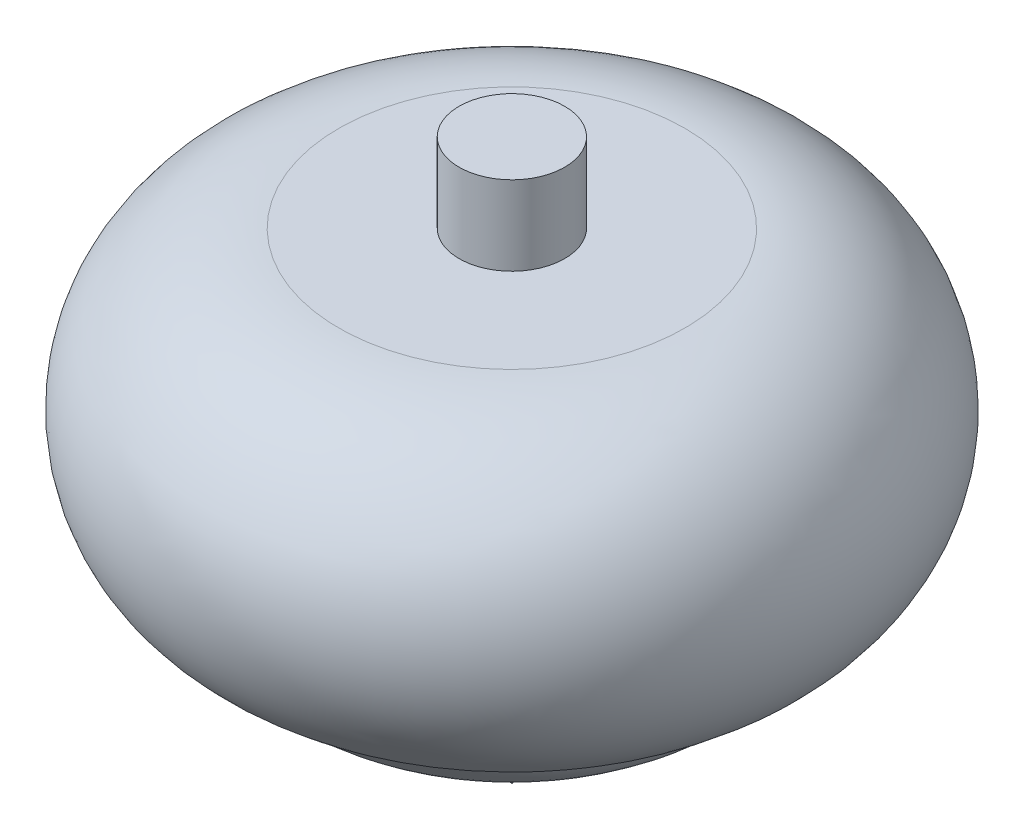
ISO-10303-21;
HEADER;
FILE_DESCRIPTION(('STEP AP214'),'2;1');
FILE_NAME('part.step','',(''),(''),'','','');
FILE_SCHEMA(('AUTOMOTIVE_DESIGN { 1 0 10303 214 1 1 1 1 }'));
ENDSEC;
DATA;
#1=APPLICATION_CONTEXT('core data for automotive mechanical design processes');
#2=APPLICATION_PROTOCOL_DEFINITION('international standard','automotive_design',2000,#1);
#3=PRODUCT_CONTEXT('',#1,'mechanical');
#4=PRODUCT('Part','Part','',(#3));
#5=PRODUCT_RELATED_PRODUCT_CATEGORY('part','',(#4));
#6=PRODUCT_DEFINITION_FORMATION('','',#4);
#7=PRODUCT_DEFINITION_CONTEXT('part definition',#1,'design');
#8=PRODUCT_DEFINITION('design','',#6,#7);
#9=PRODUCT_DEFINITION_SHAPE('','',#8);
#10=(LENGTH_UNIT() NAMED_UNIT(*) SI_UNIT(.MILLI.,.METRE.));
#11=(NAMED_UNIT(*) PLANE_ANGLE_UNIT() SI_UNIT($,.RADIAN.));
#12=(NAMED_UNIT(*) SI_UNIT($,.STERADIAN.) SOLID_ANGLE_UNIT());
#13=UNCERTAINTY_MEASURE_WITH_UNIT(LENGTH_MEASURE(1.E-05),#10,'distance_accuracy_value','');
#14=(GEOMETRIC_REPRESENTATION_CONTEXT(3) GLOBAL_UNCERTAINTY_ASSIGNED_CONTEXT((#13)) GLOBAL_UNIT_ASSIGNED_CONTEXT((#10,
#11,#12)) REPRESENTATION_CONTEXT('',''));
#15=CARTESIAN_POINT('',(0.,0.,0.));
#16=DIRECTION('',(0.,0.,1.));
#17=DIRECTION('',(1.,0.,0.));
#18=AXIS2_PLACEMENT_3D('',#15,#16,#17);
#19=CARTESIAN_POINT('',(0.,46.4387678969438,0.));
#20=DIRECTION('',(0.,-1.,0.));
#21=DIRECTION('',(0.,0.,-1.));
#22=AXIS2_PLACEMENT_3D('',#19,#20,#21);
#23=TOROIDAL_SURFACE('',#22,24.7822957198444,22.4476134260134);
#24=CARTESIAN_POINT('',(0.,68.8863813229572,0.));
#25=DIRECTION('',(0.,-1.,0.));
#26=DIRECTION('',(0.,0.,-1.));
#27=AXIS2_PLACEMENT_3D('',#24,#25,#26);
#28=CIRCLE('',#27,24.7822957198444);
#29=CARTESIAN_POINT('',(0.,68.8863813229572,-24.7822957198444));
#30=VERTEX_POINT('',#29);
#31=EDGE_CURVE('E63',#30,#30,#28,.T.);
#32=ORIENTED_EDGE('',*,*,#31,.T.);
#33=EDGE_LOOP('',(#32));
#34=FACE_BOUND('',#33,.T.);
#35=CARTESIAN_POINT('',(0.,25.622373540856,0.));
#36=DIRECTION('',(0.,-1.,0.));
#37=DIRECTION('',(0.,0.,-1.));
#38=AXIS2_PLACEMENT_3D('',#35,#36,#37);
#39=CIRCLE('',#38,33.1830739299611);
#40=CARTESIAN_POINT('',(0.,25.622373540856,-33.1830739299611));
#41=VERTEX_POINT('',#40);
#42=EDGE_CURVE('E11',#41,#41,#39,.T.);
#43=ORIENTED_EDGE('',*,*,#42,.F.);
#44=EDGE_LOOP('',(#43));
#45=FACE_BOUND('',#44,.T.);
#46=ADVANCED_FACE('F32',(#34,#45),#23,.T.);
#47=CARTESIAN_POINT('',(0.,33.8322249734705,0.));
#48=DIRECTION('',(0.,-1.,0.));
#49=DIRECTION('',(0.,0.,-1.));
#50=AXIS2_PLACEMENT_3D('',#47,#48,#49);
#51=TOROIDAL_SURFACE('',#50,18.580993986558,16.7517879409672);
#52=ORIENTED_EDGE('',*,*,#42,.T.);
#53=EDGE_LOOP('',(#52));
#54=FACE_BOUND('',#53,.T.);
#55=CARTESIAN_POINT('',(0.,17.6416342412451,0.));
#56=DIRECTION('',(0.,-1.,0.));
#57=DIRECTION('',(0.,0.,-1.));
#58=AXIS2_PLACEMENT_3D('',#55,#56,#57);
#59=CIRCLE('',#58,14.2813229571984);
#60=CARTESIAN_POINT('',(0.,17.6416342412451,-14.2813229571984));
#61=VERTEX_POINT('',#60);
#62=EDGE_CURVE('E38',#61,#61,#59,.T.);
#63=ORIENTED_EDGE('',*,*,#62,.F.);
#64=EDGE_LOOP('',(#63));
#65=FACE_BOUND('',#64,.T.);
#66=ADVANCED_FACE('F44',(#54,#65),#51,.T.);
#67=CARTESIAN_POINT('',(0.,0.,0.));
#68=DIRECTION('',(0.,1.,0.));
#69=DIRECTION('',(0.,0.,1.));
#70=AXIS2_PLACEMENT_3D('',#67,#68,#69);
#71=CONICAL_SURFACE('',#70,0.,0.680521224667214);
#72=ORIENTED_EDGE('',*,*,#62,.T.);
#73=EDGE_LOOP('',(#72));
#74=FACE_BOUND('',#73,.T.);
#75=CARTESIAN_POINT('',(0.,0.,0.));
#76=VERTEX_POINT('',#75);
#77=VERTEX_LOOP('',#76);
#78=FACE_BOUND('',#77,.T.);
#79=ADVANCED_FACE('F41',(#74,#78),#71,.T.);
#80=CARTESIAN_POINT('',(0.,80.2274319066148,0.));
#81=DIRECTION('',(0.,1.,0.));
#82=DIRECTION('',(0.,0.,1.));
#83=AXIS2_PLACEMENT_3D('',#80,#81,#82);
#84=PLANE('',#83);
#85=CARTESIAN_POINT('',(0.,80.2274319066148,0.));
#86=DIRECTION('',(0.,-1.,0.));
#87=DIRECTION('',(0.,0.,-1.));
#88=AXIS2_PLACEMENT_3D('',#85,#86,#87);
#89=CIRCLE('',#88,7.56070038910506);
#90=CARTESIAN_POINT('',(0.,80.2274319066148,-7.56070038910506));
#91=VERTEX_POINT('',#90);
#92=EDGE_CURVE('E67',#91,#91,#89,.T.);
#93=ORIENTED_EDGE('',*,*,#92,.F.);
#94=EDGE_LOOP('',(#93));
#95=FACE_BOUND('',#94,.T.);
#96=ADVANCED_FACE('F43',(#95),#84,.T.);
#97=CARTESIAN_POINT('',(0.,0.,0.));
#98=DIRECTION('',(0.,-1.,0.));
#99=DIRECTION('',(0.,0.,-1.));
#100=AXIS2_PLACEMENT_3D('',#97,#98,#99);
#101=CYLINDRICAL_SURFACE('',#100,7.56070038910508);
#102=ORIENTED_EDGE('',*,*,#92,.T.);
#103=EDGE_LOOP('',(#102));
#104=FACE_BOUND('',#103,.T.);
#105=CARTESIAN_POINT('',(0.,68.8863813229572,0.));
#106=DIRECTION('',(0.,-1.,0.));
#107=DIRECTION('',(0.,0.,-1.));
#108=AXIS2_PLACEMENT_3D('',#105,#106,#107);
#109=CIRCLE('',#108,7.56070038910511);
#110=CARTESIAN_POINT('',(0.,68.8863813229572,-7.56070038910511));
#111=VERTEX_POINT('',#110);
#112=EDGE_CURVE('E69',#111,#111,#109,.T.);
#113=ORIENTED_EDGE('',*,*,#112,.F.);
#114=EDGE_LOOP('',(#113));
#115=FACE_BOUND('',#114,.T.);
#116=ADVANCED_FACE('F51',(#104,#115),#101,.T.);
#117=CARTESIAN_POINT('',(7.56070038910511,68.8863813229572,0.));
#118=DIRECTION('',(0.,1.,0.));
#119=DIRECTION('',(0.,0.,1.));
#120=AXIS2_PLACEMENT_3D('',#117,#118,#119);
#121=PLANE('',#120);
#122=ORIENTED_EDGE('',*,*,#112,.T.);
#123=EDGE_LOOP('',(#122));
#124=FACE_BOUND('',#123,.T.);
#125=ORIENTED_EDGE('',*,*,#31,.F.);
#126=EDGE_LOOP('',(#125));
#127=FACE_BOUND('',#126,.T.);
#128=ADVANCED_FACE('F76',(#124,#127),#121,.T.);
#129=CLOSED_SHELL('',(#46,#66,#79,#96,#116,#128));
#130=MANIFOLD_SOLID_BREP('B2',#129);
#131=ADVANCED_BREP_SHAPE_REPRESENTATION('',(#18,#130),#14);
#132=SHAPE_DEFINITION_REPRESENTATION(#9,#131);
ENDSEC;
END-ISO-10303-21;
